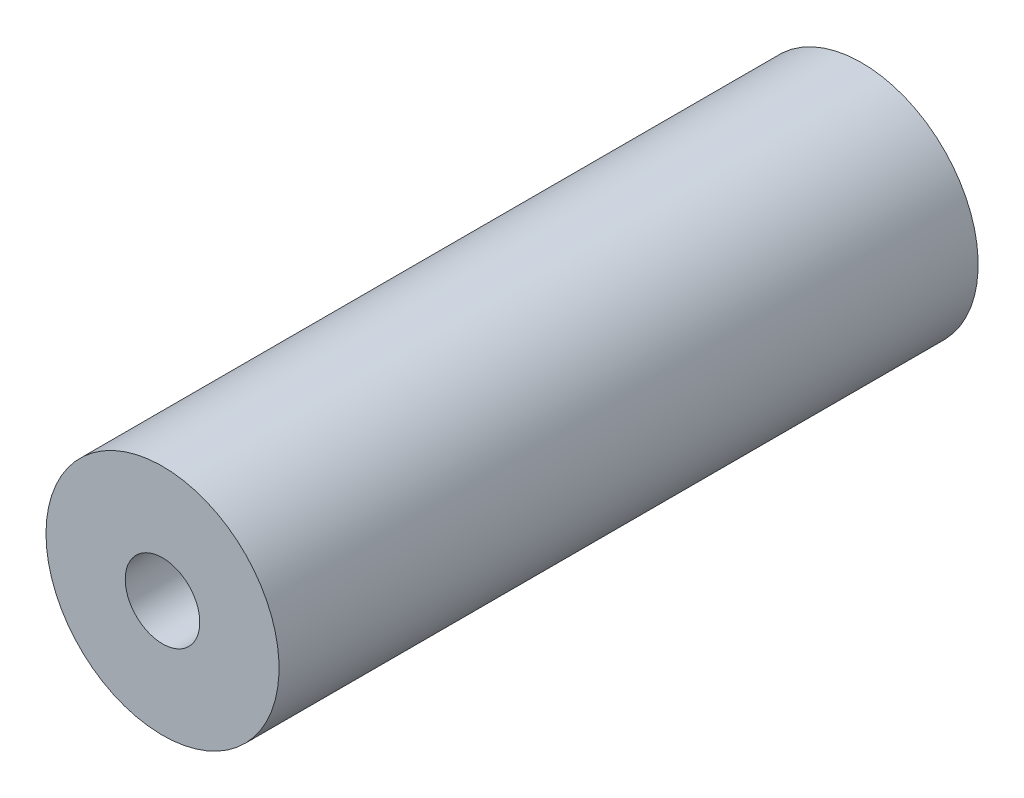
from build123d import *

# Parameters (mm, degrees)
SKETCH1_R           = 3.175
SKETCH1_R_2         = 1.016
BOSS_EXTRUDE1_DEPTH = 19.05


with BuildPart() as part:
    # Sketch1 → Boss-Extrude1 (new body)
    with BuildSketch(Plane.XY):
        with Locations(Location((0, 0, 0), (0, 0, 180))):
            Circle(SKETCH1_R)
        with Locations(Location((0, 0, 0), (0, 0, 180))):
            Circle(SKETCH1_R_2, mode=Mode.SUBTRACT)
    extrude(amount=BOSS_EXTRUDE1_DEPTH)


solid = part.part
